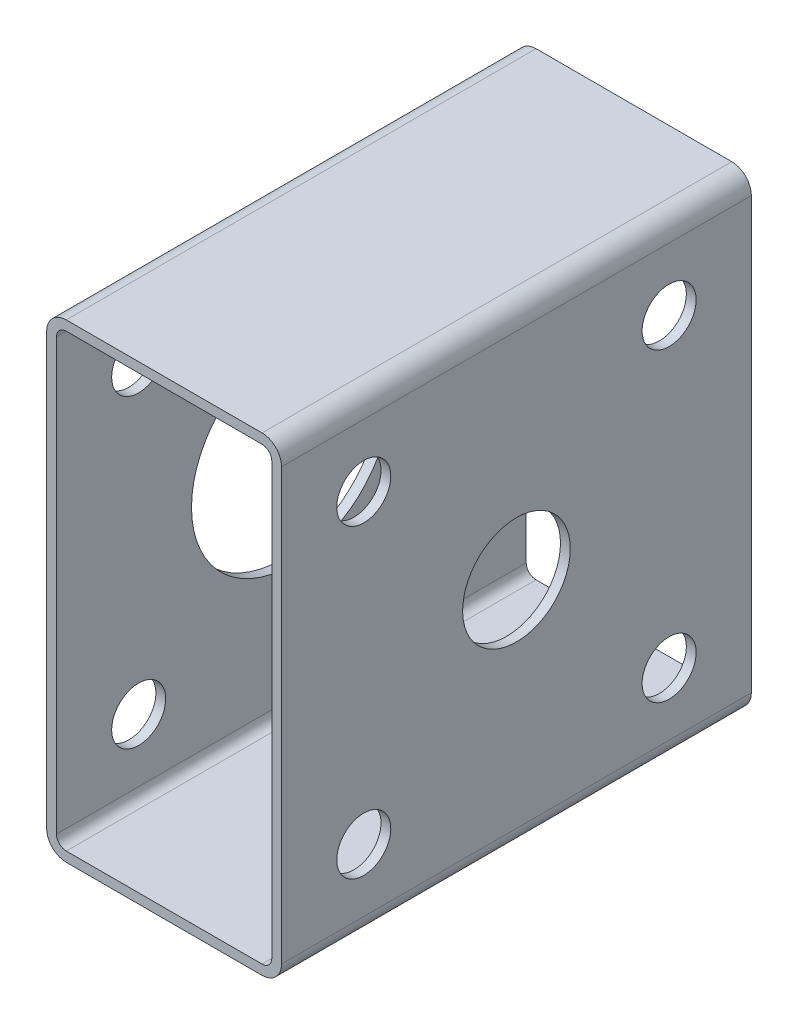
from build123d import *

# Parameters (mm, degrees)
F_3_X_6_CHANNEL_DEPTH      = 152.4
F_1_1_375_4_69_HOLES_REACH = 188.651
SKETCH2_R                  = 17.4625
SKETCH2_R_2                = 8.763
F_1_2_55_4_69_HOLES_REACH  = 188.651
SKETCH4_R                  = 32.385
SKETCH4_R_2                = 8.763


with BuildPart() as part:
    # Sketch1 → 3 X 6 CHANNEL (new body)
    with BuildSketch(Plane.XY):
        with BuildLine():
            Line((-31.75, -76.2), (31.75, -76.2))
            ThreePointArc((31.75, -76.2), (36.240128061, -74.340128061), (38.1, -69.85))
            Line((38.1, -69.85), (38.1, 69.85))
            ThreePointArc((38.1, 69.85), (36.240128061, 74.340128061), (31.75, 76.2))
            Line((31.75, 76.2), (-31.75, 76.2))
            ThreePointArc((-31.75, 76.2), (-36.240128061, 74.340128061), (-38.1, 69.85))
            Line((-38.1, 69.85), (-38.1, -69.85))
            ThreePointArc((-38.1, -69.85), (-36.240128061, -74.340128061), (-31.75, -76.2))
        make_face()
        with BuildLine():
            Line((-34.925, -69.85), (-34.925, 69.85))
            ThreePointArc((-34.925, 69.85), (-33.99506403, 72.09506403), (-31.75, 73.025))
            Line((-31.75, 73.025), (31.75, 73.025))
            ThreePointArc((31.75, 73.025), (33.99506403, 72.09506403), (34.925, 69.85))
            Line((34.925, 69.85), (34.925, -69.85))
            ThreePointArc((34.925, -69.85), (33.99506403, -72.09506403), (31.75, -73.025))
            Line((31.75, -73.025), (-31.75, -73.025))
            ThreePointArc((-31.75, -73.025), (-33.99506403, -72.09506403), (-34.925, -69.85))
        make_face(mode=Mode.SUBTRACT)
    extrude(amount=F_3_X_6_CHANNEL_DEPTH)

    # Sketch2 → 1_ 1.375 _4_ .69 HOLES (cut, up to next)
    with BuildSketch(Plane(origin=(38.1, 0, 0), x_dir=(0, 0, -1), z_dir=(1, 0, 0)), mode=Mode.PRIVATE) as f_1_1_375_4_69_holes_sk1:
        with Locations(Location((-76.2, 0, 0), (0, 0, 90))):
            Circle(SKETCH2_R)
    f_1_1_375_4_69_holes_tool1 = extrude(f_1_1_375_4_69_holes_sk1.sketch, amount=-F_1_1_375_4_69_HOLES_REACH, mode=Mode.PRIVATE) & part.part
    # Sketch2 → 1_ 1.375 _4_ .69 HOLES (cut, up to next)
    with BuildSketch(Plane(origin=(38.1, 0, 0), x_dir=(0, 0, -1), z_dir=(1, 0, 0)), mode=Mode.PRIVATE) as f_1_1_375_4_69_holes_sk2:
        with Locations(Location((-125.73, 49.53, 0), (0, 0, 90))):
            Circle(SKETCH2_R_2)
    f_1_1_375_4_69_holes_tool2 = extrude(f_1_1_375_4_69_holes_sk2.sketch, amount=-F_1_1_375_4_69_HOLES_REACH, mode=Mode.PRIVATE) & part.part
    # Sketch2 → 1_ 1.375 _4_ .69 HOLES (cut, up to next)
    with BuildSketch(Plane(origin=(38.1, 0, 0), x_dir=(0, 0, -1), z_dir=(1, 0, 0)), mode=Mode.PRIVATE) as f_1_1_375_4_69_holes_sk3:
        with Locations(Location((-26.67, 49.53, 0), (0, 0, 90))):
            Circle(SKETCH2_R_2)
    f_1_1_375_4_69_holes_tool3 = extrude(f_1_1_375_4_69_holes_sk3.sketch, amount=-F_1_1_375_4_69_HOLES_REACH, mode=Mode.PRIVATE) & part.part
    # Sketch2 → 1_ 1.375 _4_ .69 HOLES (cut, up to next)
    with BuildSketch(Plane(origin=(38.1, 0, 0), x_dir=(0, 0, -1), z_dir=(1, 0, 0)), mode=Mode.PRIVATE) as f_1_1_375_4_69_holes_sk4:
        with Locations(Location((-26.67, -49.53, 0), (0, 0, 90))):
            Circle(SKETCH2_R_2)
    f_1_1_375_4_69_holes_tool4 = extrude(f_1_1_375_4_69_holes_sk4.sketch, amount=-F_1_1_375_4_69_HOLES_REACH, mode=Mode.PRIVATE) & part.part
    # Sketch2 → 1_ 1.375 _4_ .69 HOLES (cut, up to next)
    with BuildSketch(Plane(origin=(38.1, 0, 0), x_dir=(0, 0, -1), z_dir=(1, 0, 0)), mode=Mode.PRIVATE) as f_1_1_375_4_69_holes_sk5:
        with Locations(Location((-125.73, -49.53, 0), (0, 0, 90))):
            Circle(SKETCH2_R_2)
    f_1_1_375_4_69_holes_tool5 = extrude(f_1_1_375_4_69_holes_sk5.sketch, amount=-F_1_1_375_4_69_HOLES_REACH, mode=Mode.PRIVATE) & part.part
    add(f_1_1_375_4_69_holes_tool1.solids().sort_by_distance((38.1, 0, 76.2))[0], mode=Mode.SUBTRACT)
    add(f_1_1_375_4_69_holes_tool2.solids().sort_by_distance((38.1, 49.53, 125.73))[0], mode=Mode.SUBTRACT)
    add(f_1_1_375_4_69_holes_tool3.solids().sort_by_distance((38.1, 49.53, 26.67))[0], mode=Mode.SUBTRACT)
    add(f_1_1_375_4_69_holes_tool4.solids().sort_by_distance((38.1, -49.53, 26.67))[0], mode=Mode.SUBTRACT)
    add(f_1_1_375_4_69_holes_tool5.solids().sort_by_distance((38.1, -49.53, 125.73))[0], mode=Mode.SUBTRACT)

    # Sketch4 → 1_ 2.55 _4_ .69 HOLES (cut, up to next)
    with BuildSketch(Plane.ZY.offset(38.1), mode=Mode.PRIVATE) as f_1_2_55_4_69_holes_sk1:
        with Locations(Location((76.2, 0, 0), (0, 0, 270))):
            Circle(SKETCH4_R)
    f_1_2_55_4_69_holes_tool1 = extrude(f_1_2_55_4_69_holes_sk1.sketch, amount=-F_1_2_55_4_69_HOLES_REACH, mode=Mode.PRIVATE) & part.part
    # Sketch4 → 1_ 2.55 _4_ .69 HOLES (cut, up to next)
    with BuildSketch(Plane.ZY.offset(38.1), mode=Mode.PRIVATE) as f_1_2_55_4_69_holes_sk2:
        with Locations(Location((26.67, 49.53, 0), (0, 0, 90))):
            Circle(SKETCH4_R_2)
    f_1_2_55_4_69_holes_tool2 = extrude(f_1_2_55_4_69_holes_sk2.sketch, amount=-F_1_2_55_4_69_HOLES_REACH, mode=Mode.PRIVATE) & part.part
    # Sketch4 → 1_ 2.55 _4_ .69 HOLES (cut, up to next)
    with BuildSketch(Plane.ZY.offset(38.1), mode=Mode.PRIVATE) as f_1_2_55_4_69_holes_sk3:
        with Locations(Location((125.73, 49.53, 0), (0, 0, 90))):
            Circle(SKETCH4_R_2)
    f_1_2_55_4_69_holes_tool3 = extrude(f_1_2_55_4_69_holes_sk3.sketch, amount=-F_1_2_55_4_69_HOLES_REACH, mode=Mode.PRIVATE) & part.part
    # Sketch4 → 1_ 2.55 _4_ .69 HOLES (cut, up to next)
    with BuildSketch(Plane.ZY.offset(38.1), mode=Mode.PRIVATE) as f_1_2_55_4_69_holes_sk4:
        with Locations(Location((26.67, -49.53, 0), (0, 0, 90))):
            Circle(SKETCH4_R_2)
    f_1_2_55_4_69_holes_tool4 = extrude(f_1_2_55_4_69_holes_sk4.sketch, amount=-F_1_2_55_4_69_HOLES_REACH, mode=Mode.PRIVATE) & part.part
    # Sketch4 → 1_ 2.55 _4_ .69 HOLES (cut, up to next)
    with BuildSketch(Plane.ZY.offset(38.1), mode=Mode.PRIVATE) as f_1_2_55_4_69_holes_sk5:
        with Locations(Location((125.73, -49.53, 0), (0, 0, 90))):
            Circle(SKETCH4_R_2)
    f_1_2_55_4_69_holes_tool5 = extrude(f_1_2_55_4_69_holes_sk5.sketch, amount=-F_1_2_55_4_69_HOLES_REACH, mode=Mode.PRIVATE) & part.part
    add(f_1_2_55_4_69_holes_tool1.solids().sort_by_distance((-38.1, 0, 76.2))[0], mode=Mode.SUBTRACT)
    add(f_1_2_55_4_69_holes_tool2.solids().sort_by_distance((-38.1, 49.53, 26.67))[0], mode=Mode.SUBTRACT)
    add(f_1_2_55_4_69_holes_tool3.solids().sort_by_distance((-38.1, 49.53, 125.73))[0], mode=Mode.SUBTRACT)
    add(f_1_2_55_4_69_holes_tool4.solids().sort_by_distance((-38.1, -49.53, 26.67))[0], mode=Mode.SUBTRACT)
    add(f_1_2_55_4_69_holes_tool5.solids().sort_by_distance((-38.1, -49.53, 125.73))[0], mode=Mode.SUBTRACT)


solid = part.part
